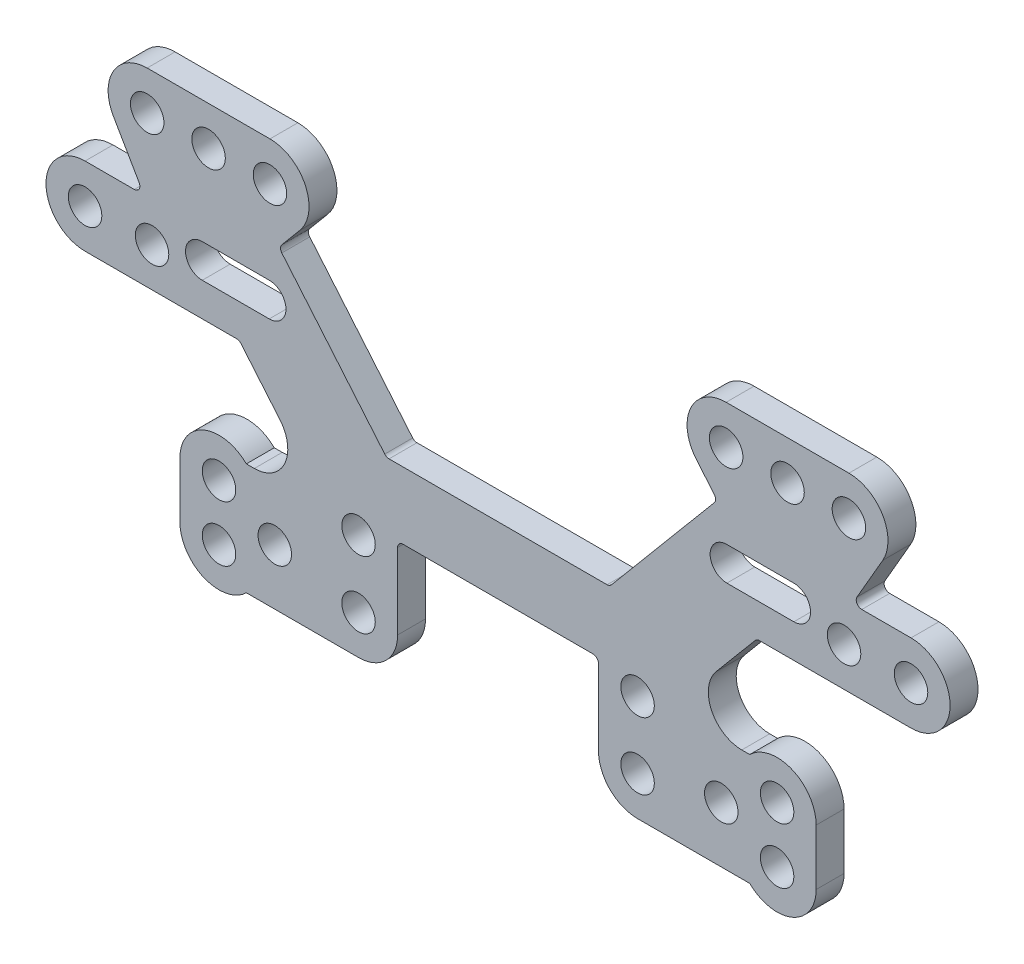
from build123d import *

# Parameters (mm, degrees)
ESQUISSE1_R          = 1.5
BASE_EXTRUSION_DEPTH = 2.5


with BuildPart() as part:
    # Esquisse1 → Base-Extrusion (new body)
    with BuildSketch(Plane(origin=(0, 0, -2.5), x_dir=(-1, 0, 0), z_dir=(0, 0, -1))):
        with BuildLine():
            Line((2.971837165, -3.378625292), (2.971837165, 3.405031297))
            ThreePointArc((2.971837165, 3.405031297), (3.118283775, 3.758584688), (3.471837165, 3.905031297))
            Line((3.471837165, 3.905031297), (20.471837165, 3.905031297))
            ThreePointArc((20.471837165, 3.905031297), (20.825390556, 3.758584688), (20.971837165, 3.405031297))
            Line((20.971837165, 3.405031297), (20.971837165, -3.378625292))
            ThreePointArc((20.971837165, -3.378625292), (21.996963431, -5.853499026), (24.471837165, -6.878625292))
            Line((24.471837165, -6.878625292), (34.522347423, -6.878625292))
            ThreePointArc((34.522347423, -6.878625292), (38.327710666, -7.605327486), (40.471837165, -4.378625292))
            Line((40.471837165, -4.378625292), (40.471837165, 0.621374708))
            ThreePointArc((40.471837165, 0.621374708), (38.327710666, 3.848076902), (34.522347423, 3.121374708))
            Line((34.522347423, 3.121374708), (33.809156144, 3.121374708))
            ThreePointArc((33.809156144, 3.121374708), (31.090232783, 4.853519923), (31.511022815, 8.049737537))
            Line((31.511022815, 8.049737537), (35.007848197, 12.217091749))
            ThreePointArc((35.007848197, 12.217091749), (35.179561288, 12.348851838), (35.390870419, 12.395697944))
            Line((35.390870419, 12.395697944), (48.971837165, 12.395697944))
            ThreePointArc((48.971837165, 12.395697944), (52.471837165, 15.895697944), (48.971837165, 19.395697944))
            Line((48.971837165, 19.395697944), (44.561329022, 19.395697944))
            ThreePointArc((44.561329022, 19.395697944), (44.12831632, 19.645697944), (44.12831632, 20.145697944))
            Line((44.12831632, 20.145697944), (46.437717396, 24.145697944))
            ThreePointArc((46.437717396, 24.145697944), (46.437717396, 27.645697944), (43.406628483, 29.395697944))
            Line((43.406628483, 29.395697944), (32.406628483, 29.395697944))
            ThreePointArc((32.406628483, 29.395697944), (29.234551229, 27.37486186), (29.725472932, 23.64594131))
            Line((29.725472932, 23.64594131), (31.343969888, 21.717091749))
            ThreePointArc((31.343969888, 21.717091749), (31.460947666, 21.395697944), (31.343969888, 21.074304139))
            Line((31.343969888, 21.074304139), (22.121705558, 10.083637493))
            ThreePointArc((22.121705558, 10.083637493), (21.949992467, 9.951877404), (21.738683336, 9.905031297))
            Line((21.738683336, 9.905031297), (2.204990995, 9.905031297))
            ThreePointArc((2.204990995, 9.905031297), (1.993681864, 9.951877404), (1.821968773, 10.083637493))
            Line((1.821968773, 10.083637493), (-7.400295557, 21.074304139))
            ThreePointArc((-7.400295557, 21.074304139), (-7.517273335, 21.395697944), (-7.400295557, 21.717091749))
            Line((-7.400295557, 21.717091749), (-5.781798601, 23.64594131))
            ThreePointArc((-5.781798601, 23.64594131), (-5.290876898, 27.37486186), (-8.462954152, 29.395697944))
            Line((-8.462954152, 29.395697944), (-19.462954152, 29.395697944))
            ThreePointArc((-19.462954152, 29.395697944), (-22.494043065, 27.645697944), (-22.494043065, 24.145697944))
            Line((-22.494043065, 24.145697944), (-20.184641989, 20.145697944))
            ThreePointArc((-20.184641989, 20.145697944), (-20.184641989, 19.645697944), (-20.617654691, 19.395697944))
            Line((-20.617654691, 19.395697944), (-25.028162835, 19.395697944))
            ThreePointArc((-25.028162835, 19.395697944), (-28.528162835, 15.895697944), (-25.028162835, 12.395697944))
            Line((-25.028162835, 12.395697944), (-11.447196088, 12.395697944))
            ThreePointArc((-11.447196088, 12.395697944), (-11.235886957, 12.348851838), (-11.064173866, 12.217091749))
            Line((-11.064173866, 12.217091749), (-7.567348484, 8.049737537))
            ThreePointArc((-7.567348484, 8.049737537), (-7.146558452, 4.853519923), (-9.865481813, 3.121374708))
            Line((-9.865481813, 3.121374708), (-10.578673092, 3.121374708))
            ThreePointArc((-10.578673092, 3.121374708), (-14.384036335, 3.848076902), (-16.528162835, 0.621374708))
            Line((-16.528162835, 0.621374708), (-16.528162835, -4.378625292))
            ThreePointArc((-16.528162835, -4.378625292), (-14.384036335, -7.605327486), (-10.578673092, -6.878625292))
            Line((-10.578673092, -6.878625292), (-0.528162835, -6.878625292))
            ThreePointArc((-0.528162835, -6.878625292), (1.9467109, -5.853499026), (2.971837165, -3.378625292))
        make_face()
        with Locations(Location((37.906628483, 25.895697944, 0), (0, 0, 180))):
            Circle(ESQUISSE1_R, mode=Mode.SUBTRACT)
        with Locations(Location((42.971837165, 15.895697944, 0), (0, 0, 180))):
            Circle(ESQUISSE1_R, mode=Mode.SUBTRACT)
        with Locations(Location((31.971837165, -1.878625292, 0), (0, 0, 180))):
            Circle(ESQUISSE1_R, mode=Mode.SUBTRACT)
        with Locations(Location((24.471837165, 2.621374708, 0), (0, 0, 180))):
            Circle(ESQUISSE1_R, mode=Mode.SUBTRACT)
        with Locations(Location((24.471837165, -3.378625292, 0), (0, 0, 180))):
            Circle(ESQUISSE1_R, mode=Mode.SUBTRACT)
        with Locations(Location((36.971837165, -4.378625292, 0), (0, 0, 180))):
            Circle(ESQUISSE1_R, mode=Mode.SUBTRACT)
        with Locations(Location((36.971837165, 0.621374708, 0), (0, 0, 180))):
            Circle(ESQUISSE1_R, mode=Mode.SUBTRACT)
        with Locations(Location((48.971837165, 15.895697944, 0), (0, 0, 180))):
            Circle(ESQUISSE1_R, mode=Mode.SUBTRACT)
        with Locations(Location((43.406628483, 25.895697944, 0), (0, 0, 180))):
            Circle(ESQUISSE1_R, mode=Mode.SUBTRACT)
        with Locations(Location((32.406628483, 25.895697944, 0), (0, 0, 180))):
            Circle(ESQUISSE1_R, mode=Mode.SUBTRACT)
        with Locations(Location((-13.962954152, 25.895697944, 0), (0, 0, 180))):
            Circle(ESQUISSE1_R, mode=Mode.SUBTRACT)
        with Locations(Location((-19.028162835, 15.895697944, 0), (0, 0, 180))):
            Circle(ESQUISSE1_R, mode=Mode.SUBTRACT)
        with Locations(Location((-8.028162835, -1.878625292, 0), (0, 0, 180))):
            Circle(ESQUISSE1_R, mode=Mode.SUBTRACT)
        with Locations(Location((-0.528162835, 2.621374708, 0), (0, 0, 180))):
            Circle(ESQUISSE1_R, mode=Mode.SUBTRACT)
        with Locations(Location((-0.528162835, -3.378625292, 0), (0, 0, 180))):
            Circle(ESQUISSE1_R, mode=Mode.SUBTRACT)
        with Locations(Location((-13.028162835, -4.378625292, 0), (0, 0, 180))):
            Circle(ESQUISSE1_R, mode=Mode.SUBTRACT)
        with Locations(Location((-13.028162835, 0.621374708, 0), (0, 0, 180))):
            Circle(ESQUISSE1_R, mode=Mode.SUBTRACT)
        with Locations(Location((-25.028162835, 15.895697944, 0), (0, 0, 180))):
            Circle(ESQUISSE1_R, mode=Mode.SUBTRACT)
        with Locations(Location((-19.462954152, 25.895697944, 0), (0, 0, 180))):
            Circle(ESQUISSE1_R, mode=Mode.SUBTRACT)
        with Locations(Location((-8.462954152, 25.895697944, 0), (0, 0, 180))):
            Circle(ESQUISSE1_R, mode=Mode.SUBTRACT)
        with BuildLine():
            Line((38.471837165, 15.395697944), (32.471837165, 15.395697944))
            ThreePointArc((32.471837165, 15.395697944), (30.971837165, 16.895697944), (32.471837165, 18.395697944))
            Line((32.471837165, 18.395697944), (38.471837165, 18.395697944))
            ThreePointArc((38.471837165, 18.395697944), (39.971837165, 16.895697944), (38.471837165, 15.395697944))
        make_face(mode=Mode.SUBTRACT)
        with BuildLine():
            Line((-8.528162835, 15.395697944), (-14.528162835, 15.395697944))
            ThreePointArc((-14.528162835, 15.395697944), (-16.028162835, 16.895697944), (-14.528162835, 18.395697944))
            Line((-14.528162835, 18.395697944), (-8.528162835, 18.395697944))
            ThreePointArc((-8.528162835, 18.395697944), (-7.028162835, 16.895697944), (-8.528162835, 15.395697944))
        make_face(mode=Mode.SUBTRACT)
    extrude(amount=-BASE_EXTRUSION_DEPTH)


solid = part.part
